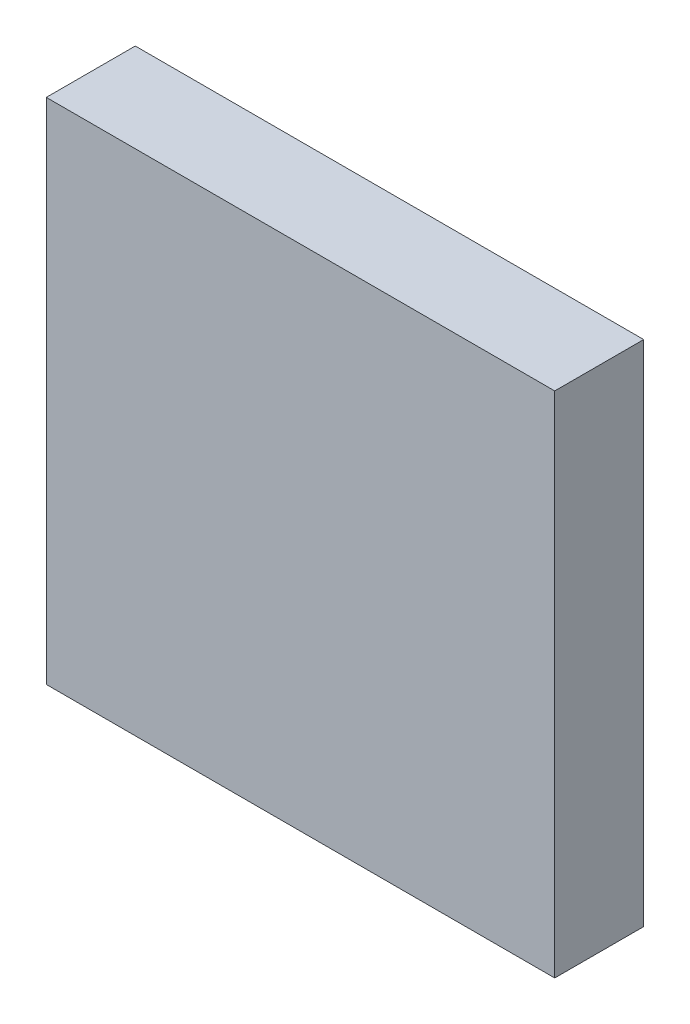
from build123d import *

# Parameters (mm, degrees)
ESQUISSE1_W          = 20
ESQUISSE1_H          = 20
BASE_EXTRUSION_DEPTH = 3.5


with BuildPart() as part:
    # Esquisse1 → Base-Extrusion (new body)
    with BuildSketch(Plane.XY):
        with Locations((-30, 50)):
            Rectangle(ESQUISSE1_W, ESQUISSE1_H)
    extrude(amount=BASE_EXTRUSION_DEPTH)


solid = part.part
